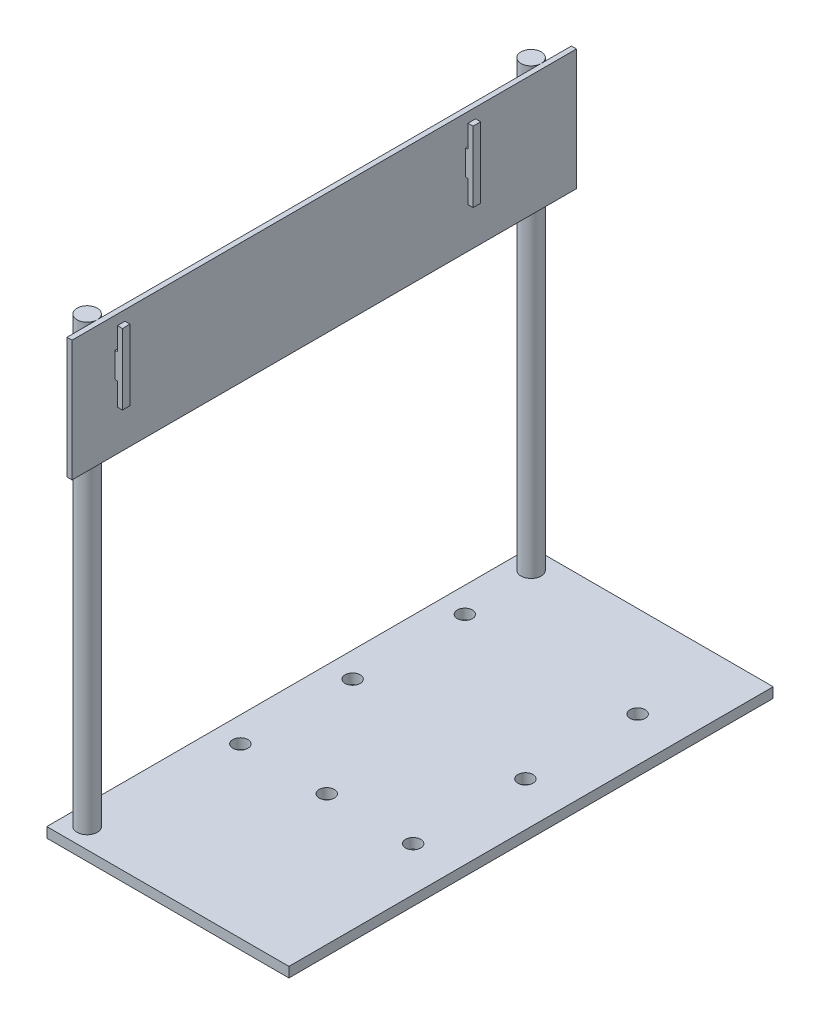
from build123d import *

# Parameters (mm, degrees)
SKETCH1_W           = 609.6
SKETCH1_H           = 1219.2
BOSS_EXTRUDE1_DEPTH = 25.4
SKETCH2_R           = 25.4
BOSS_EXTRUDE2_DEPTH = 1117.6
BOSS_EXTRUDE3_START = -76.2
SKETCH3_W           = 1270
SKETCH3_H           = 304.8
BOSS_EXTRUDE3_DEPTH = 12.7
BOSS_EXTRUDE4_START = 508
BOSS_EXTRUDE4_DEPTH = 19.05
BOSS_EXTRUDE5_START = -355.6
BOSS_EXTRUDE5_DEPTH = 19.05
SKETCH6_R           = 19.05
CUT_EXTRUDE1_DEPTH  = 25.4


with BuildPart() as part:
    # Sketch1 → Boss-Extrude1 (new body)
    with BuildSketch(Plane(origin=(0, 0, 0), x_dir=(1, 0, 0), z_dir=(0, 1, 0))):
        Rectangle(SKETCH1_W, SKETCH1_H)
    extrude(amount=BOSS_EXTRUDE1_DEPTH)

    # Sketch2 → Boss-Extrude2 (add)
    with BuildSketch(Plane(origin=(0, 25.4, 0), x_dir=(1, 0, 0), z_dir=(0, 1, 0))):
        with Locations(Location((-254, 558.8, 0), (0, 0, 270))):
            Circle(SKETCH2_R)
        with Locations(Location((-254, -558.8, 0), (0, 0, 270))):
            Circle(SKETCH2_R)
    extrude(amount=BOSS_EXTRUDE2_DEPTH)

    # Sketch6 → Cut-Extrude1 (cut)
    with BuildSketch(Plane(origin=(0, 25.4, 0), x_dir=(1, 0, 0), z_dir=(0, 1, 0))):
        with Locations(Location((-241.3, 379.4125, 0), (0, 0, 270))):
            Circle(SKETCH6_R)
        with Locations(Location((-241.3, 96.8375, 0), (0, 0, 270))):
            Circle(SKETCH6_R)
        with Locations(Location((193.675, 379.4125, 0), (0, 0, 270))):
            Circle(SKETCH6_R)
        with Locations(Location((193.675, 96.8375, 0), (0, 0, 270))):
            Circle(SKETCH6_R)
        with Locations(Location((-241.3, -185.7375, 0), (0, 0, 270))):
            Circle(SKETCH6_R)
        with Locations(Location((-23.8125, -185.7375, 0), (0, 0, 270))):
            Circle(SKETCH6_R)
        with Locations(Location((193.675, -185.7375, 0), (0, 0, 270))):
            Circle(SKETCH6_R)
    extrude(amount=-CUT_EXTRUDE1_DEPTH, mode=Mode.SUBTRACT)


with BuildPart() as body_2:
    # Sketch3 → Boss-Extrude3 (new body)
    with BuildSketch(Plane.ZY.offset(304.8).offset(BOSS_EXTRUDE3_START)):
        with Locations((0, 990.6)):
            Rectangle(SKETCH3_W, SKETCH3_H)
    extrude(amount=-BOSS_EXTRUDE3_DEPTH)

    # Sketch4 → Boss-Extrude4 (add)
    with BuildSketch(Plane.XY.offset(BOSS_EXTRUDE4_START)):
        Polygon((-228.6, 1066.8), (-209.55, 1066.8), (-209.55, 1123.95), (-196.85, 1123.95), (-196.85, 946.15), (-209.55, 946.15), (-209.55, 1003.3), (-228.6, 1003.3), align=None)
    extrude(amount=BOSS_EXTRUDE4_DEPTH)

    # Sketch4_2 → Boss-Extrude5 (add)
    with BuildSketch(Plane.XY.offset(BOSS_EXTRUDE5_START)):
        Polygon((-228.6, 1066.8), (-209.55, 1066.8), (-209.55, 1123.95), (-196.85, 1123.95), (-196.85, 946.15), (-209.55, 946.15), (-209.55, 1003.3), (-228.6, 1003.3), align=None)
    extrude(amount=-BOSS_EXTRUDE5_DEPTH)


solid = Compound([part.part, body_2.part])
